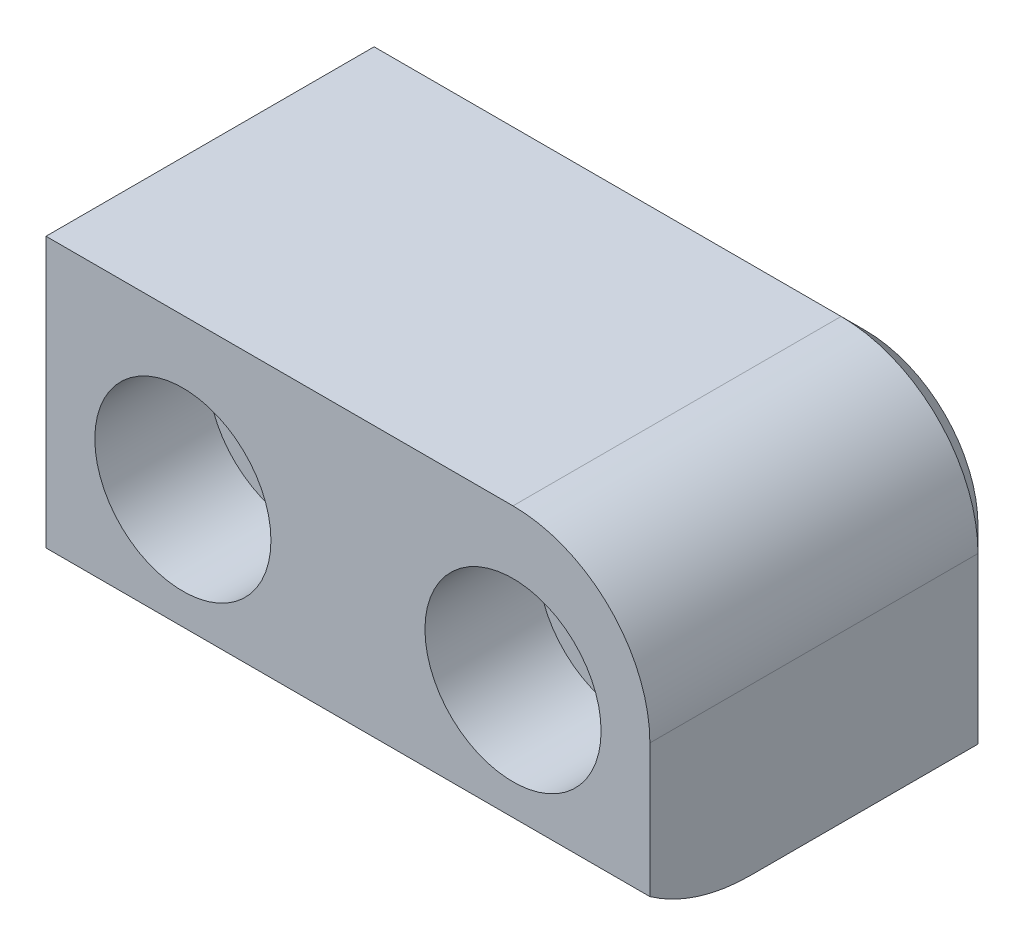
from build123d import *

# Parameters (mm, degrees)
SKETCH3_W                  = 38.1
SKETCH3_H                  = 19.05
EXTRUDE1_DEPTH             = 22.225
FILLET1_R                  = 8.636
F_1_4_20_CBORE_D           = 6.5278
F_1_4_20_CBORE_CBORE_D     = 11.1125
F_1_4_20_CBORE_CBORE_DEPTH = 7.14502
CUT_EXTRUDE1_DEPTH         = 49.046468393
CHAMFER1_SIZE              = 1.524


with BuildPart() as part:
    # Sketch3 → Extrude1 (new body)
    with BuildSketch(Plane.XY):
        with Locations((19.05, 9.525)):
            Rectangle(SKETCH3_W, SKETCH3_H)
    extrude(amount=-EXTRUDE1_DEPTH)

    # Fillet1
    fillet1_edges = [part.edges().sort_by_distance(p)[0] for p in [
        (38.1, 19.05, -11.1125),
    ]]
    fillet(fillet1_edges, radius=FILLET1_R)

    # 1_4_-20 CBORE (through all)
    with Locations(Plane.XY):
        with Locations((8.636, 9.525), (29.464, 9.525)):
            CounterBoreHole(F_1_4_20_CBORE_D / 2, F_1_4_20_CBORE_CBORE_D / 2, F_1_4_20_CBORE_CBORE_DEPTH)

    # Sketch8 → Cut-Extrude1 (cut, through all)
    with BuildSketch(Plane.ZY):
        with BuildLine():
            Line((0, 2.016820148), (12.7, 2.016820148))
            Line((12.7, 2.016820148), (12.7, -10.683179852))
            Line((12.7, -10.683179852), (-6.35, -10.683179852))
            Line((-6.35, -10.683179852), (-6.35, 0))
            ThreePointArc((-6.35, 0), (-3.018706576, 0.516316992), (0, 2.016820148))
        make_face()
    extrude(amount=-CUT_EXTRUDE1_DEPTH, mode=Mode.SUBTRACT)

    # Chamfer1
    chamfer1_edges = [part.edges().sort_by_distance(p)[0] for p in [
        (38.1, 5.207, -22.225),
        (14.732, 19.05, -22.225),
        (35.570574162, 16.520574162, -22.225),
    ]]
    chamfer(chamfer1_edges, length=CHAMFER1_SIZE)


solid = part.part
